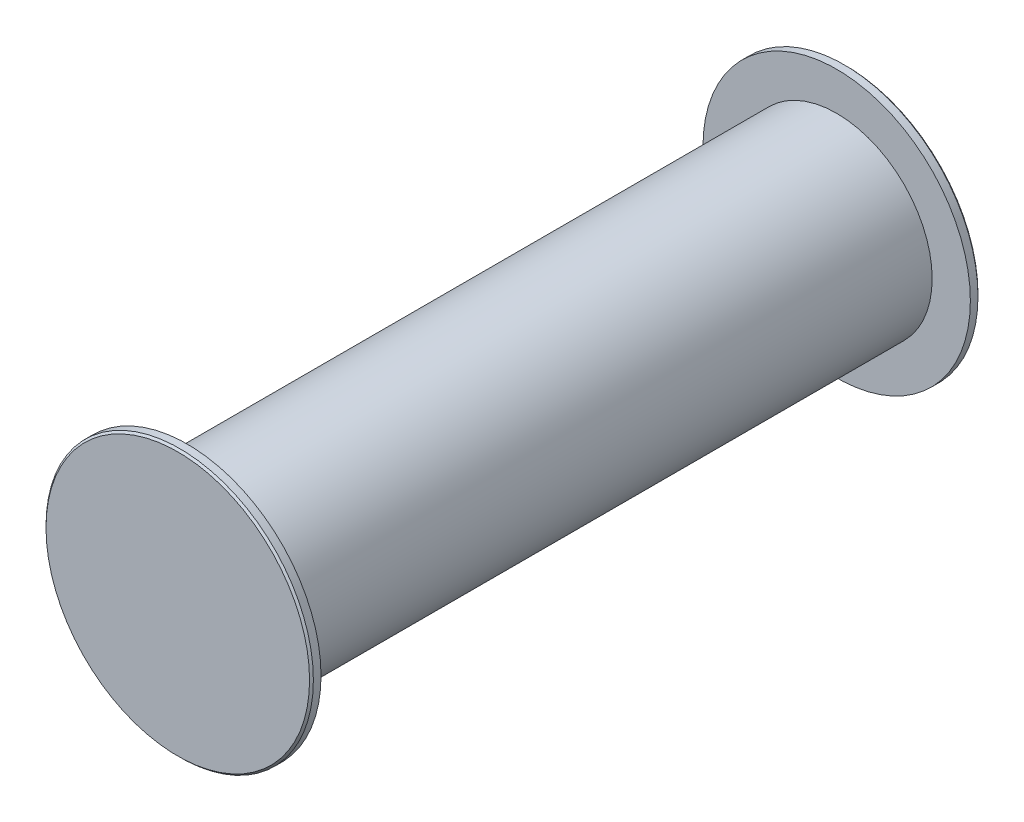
ISO-10303-21;
HEADER;
FILE_DESCRIPTION(('STEP AP214'),'2;1');
FILE_NAME('part.step','',(''),(''),'','','');
FILE_SCHEMA(('AUTOMOTIVE_DESIGN { 1 0 10303 214 1 1 1 1 }'));
ENDSEC;
DATA;
#1=APPLICATION_CONTEXT('core data for automotive mechanical design processes');
#2=APPLICATION_PROTOCOL_DEFINITION('international standard','automotive_design',2000,#1);
#3=PRODUCT_CONTEXT('',#1,'mechanical');
#4=PRODUCT('Part','Part','',(#3));
#5=PRODUCT_RELATED_PRODUCT_CATEGORY('part','',(#4));
#6=PRODUCT_DEFINITION_FORMATION('','',#4);
#7=PRODUCT_DEFINITION_CONTEXT('part definition',#1,'design');
#8=PRODUCT_DEFINITION('design','',#6,#7);
#9=PRODUCT_DEFINITION_SHAPE('','',#8);
#10=(LENGTH_UNIT() NAMED_UNIT(*) SI_UNIT(.MILLI.,.METRE.));
#11=(NAMED_UNIT(*) PLANE_ANGLE_UNIT() SI_UNIT($,.RADIAN.));
#12=(NAMED_UNIT(*) SI_UNIT($,.STERADIAN.) SOLID_ANGLE_UNIT());
#13=UNCERTAINTY_MEASURE_WITH_UNIT(LENGTH_MEASURE(1.E-05),#10,'distance_accuracy_value','');
#14=(GEOMETRIC_REPRESENTATION_CONTEXT(3) GLOBAL_UNCERTAINTY_ASSIGNED_CONTEXT((#13)) GLOBAL_UNIT_ASSIGNED_CONTEXT((#10,
#11,#12)) REPRESENTATION_CONTEXT('',''));
#15=CARTESIAN_POINT('',(0.,0.,0.));
#16=DIRECTION('',(0.,0.,1.));
#17=DIRECTION('',(1.,0.,0.));
#18=AXIS2_PLACEMENT_3D('',#15,#16,#17);
#19=CARTESIAN_POINT('',(0.,0.,34.));
#20=DIRECTION('',(0.,0.,-1.));
#21=DIRECTION('',(-1.,0.,0.));
#22=AXIS2_PLACEMENT_3D('',#19,#20,#21);
#23=CYLINDRICAL_SURFACE('',#22,5.);
#24=CARTESIAN_POINT('',(0.,0.,34.));
#25=DIRECTION('',(0.,0.,1.));
#26=DIRECTION('',(1.,0.,0.));
#27=AXIS2_PLACEMENT_3D('',#24,#25,#26);
#28=CIRCLE('',#27,5.);
#29=CARTESIAN_POINT('',(5.,0.,34.));
#30=VERTEX_POINT('',#29);
#31=EDGE_CURVE('E49',#30,#30,#28,.T.);
#32=ORIENTED_EDGE('',*,*,#31,.F.);
#33=EDGE_LOOP('',(#32));
#34=FACE_BOUND('',#33,.T.);
#35=CARTESIAN_POINT('',(0.,0.,0.));
#36=DIRECTION('',(0.,0.,-1.));
#37=DIRECTION('',(-1.,0.,0.));
#38=AXIS2_PLACEMENT_3D('',#35,#36,#37);
#39=CIRCLE('',#38,5.);
#40=CARTESIAN_POINT('',(-5.,0.,0.));
#41=VERTEX_POINT('',#40);
#42=EDGE_CURVE('E55',#41,#41,#39,.T.);
#43=ORIENTED_EDGE('',*,*,#42,.F.);
#44=EDGE_LOOP('',(#43));
#45=FACE_BOUND('',#44,.T.);
#46=ADVANCED_FACE('F30',(#34,#45),#23,.T.);
#47=CARTESIAN_POINT('',(0.,0.,34.));
#48=DIRECTION('',(0.,0.,1.));
#49=DIRECTION('',(1.,0.,0.));
#50=AXIS2_PLACEMENT_3D('',#47,#48,#49);
#51=PLANE('',#50);
#52=CARTESIAN_POINT('',(0.,0.,34.));
#53=DIRECTION('',(0.,0.,1.));
#54=DIRECTION('',(1.,0.,0.));
#55=AXIS2_PLACEMENT_3D('',#52,#53,#54);
#56=CIRCLE('',#55,7.);
#57=CARTESIAN_POINT('',(7.,0.,34.));
#58=VERTEX_POINT('',#57);
#59=EDGE_CURVE('E52',#58,#58,#56,.T.);
#60=ORIENTED_EDGE('',*,*,#59,.F.);
#61=EDGE_LOOP('',(#60));
#62=FACE_BOUND('',#61,.T.);
#63=ORIENTED_EDGE('',*,*,#31,.T.);
#64=EDGE_LOOP('',(#63));
#65=FACE_BOUND('',#64,.T.);
#66=ADVANCED_FACE('F72',(#62,#65),#51,.F.);
#67=CARTESIAN_POINT('',(0.,0.,34.5));
#68=DIRECTION('',(0.,0.,-1.));
#69=DIRECTION('',(-1.,0.,0.));
#70=AXIS2_PLACEMENT_3D('',#67,#68,#69);
#71=CYLINDRICAL_SURFACE('',#70,7.);
#72=CARTESIAN_POINT('',(0.,0.,34.4));
#73=DIRECTION('',(0.,0.,1.));
#74=DIRECTION('',(1.,0.,0.));
#75=AXIS2_PLACEMENT_3D('',#72,#73,#74);
#76=CIRCLE('',#75,7.);
#77=CARTESIAN_POINT('',(7.,0.,34.4));
#78=VERTEX_POINT('',#77);
#79=EDGE_CURVE('E40',#78,#78,#76,.F.);
#80=ORIENTED_EDGE('',*,*,#79,.T.);
#81=EDGE_LOOP('',(#80));
#82=FACE_BOUND('',#81,.T.);
#83=ORIENTED_EDGE('',*,*,#59,.T.);
#84=EDGE_LOOP('',(#83));
#85=FACE_BOUND('',#84,.T.);
#86=ADVANCED_FACE('F77',(#82,#85),#71,.T.);
#87=CARTESIAN_POINT('',(0.,0.,34.5));
#88=DIRECTION('',(0.,0.,1.));
#89=DIRECTION('',(1.,0.,0.));
#90=AXIS2_PLACEMENT_3D('',#87,#88,#89);
#91=PLANE('',#90);
#92=CARTESIAN_POINT('',(0.,0.,34.5));
#93=DIRECTION('',(0.,0.,1.));
#94=DIRECTION('',(1.,0.,0.));
#95=AXIS2_PLACEMENT_3D('',#92,#93,#94);
#96=CIRCLE('',#95,6.9);
#97=CARTESIAN_POINT('',(6.9,0.,34.5));
#98=VERTEX_POINT('',#97);
#99=EDGE_CURVE('E44',#98,#98,#96,.T.);
#100=ORIENTED_EDGE('',*,*,#99,.T.);
#101=EDGE_LOOP('',(#100));
#102=FACE_BOUND('',#101,.T.);
#103=ADVANCED_FACE('F85',(#102),#91,.T.);
#104=CARTESIAN_POINT('',(0.,0.,34.5));
#105=DIRECTION('',(0.,0.,-1.));
#106=DIRECTION('',(-1.,0.,0.));
#107=AXIS2_PLACEMENT_3D('',#104,#105,#106);
#108=CONICAL_SURFACE('',#107,6.9,0.785398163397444);
#109=ORIENTED_EDGE('',*,*,#79,.F.);
#110=EDGE_LOOP('',(#109));
#111=FACE_BOUND('',#110,.T.);
#112=ORIENTED_EDGE('',*,*,#99,.F.);
#113=EDGE_LOOP('',(#112));
#114=FACE_BOUND('',#113,.T.);
#115=ADVANCED_FACE('F67',(#111,#114),#108,.T.);
#116=CARTESIAN_POINT('',(0.,0.,0.));
#117=DIRECTION('',(0.,0.,-1.));
#118=DIRECTION('',(-1.,0.,0.));
#119=AXIS2_PLACEMENT_3D('',#116,#117,#118);
#120=PLANE('',#119);
#121=CARTESIAN_POINT('',(0.,0.,0.));
#122=DIRECTION('',(0.,0.,-1.));
#123=DIRECTION('',(-1.,0.,0.));
#124=AXIS2_PLACEMENT_3D('',#121,#122,#123);
#125=CIRCLE('',#124,7.);
#126=CARTESIAN_POINT('',(-7.,0.,0.));
#127=VERTEX_POINT('',#126);
#128=EDGE_CURVE('E58',#127,#127,#125,.T.);
#129=ORIENTED_EDGE('',*,*,#128,.F.);
#130=EDGE_LOOP('',(#129));
#131=FACE_BOUND('',#130,.T.);
#132=ORIENTED_EDGE('',*,*,#42,.T.);
#133=EDGE_LOOP('',(#132));
#134=FACE_BOUND('',#133,.T.);
#135=ADVANCED_FACE('F64',(#131,#134),#120,.F.);
#136=CARTESIAN_POINT('',(0.,0.,-0.5));
#137=DIRECTION('',(0.,0.,1.));
#138=DIRECTION('',(1.,0.,0.));
#139=AXIS2_PLACEMENT_3D('',#136,#137,#138);
#140=CYLINDRICAL_SURFACE('',#139,7.);
#141=CARTESIAN_POINT('',(0.,0.,-0.400000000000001));
#142=DIRECTION('',(0.,0.,-1.));
#143=DIRECTION('',(-1.,0.,0.));
#144=AXIS2_PLACEMENT_3D('',#141,#142,#143);
#145=CIRCLE('',#144,7.);
#146=CARTESIAN_POINT('',(-7.,0.,-0.400000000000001));
#147=VERTEX_POINT('',#146);
#148=EDGE_CURVE('E10',#147,#147,#145,.F.);
#149=ORIENTED_EDGE('',*,*,#148,.T.);
#150=EDGE_LOOP('',(#149));
#151=FACE_BOUND('',#150,.T.);
#152=ORIENTED_EDGE('',*,*,#128,.T.);
#153=EDGE_LOOP('',(#152));
#154=FACE_BOUND('',#153,.T.);
#155=ADVANCED_FACE('F62',(#151,#154),#140,.T.);
#156=CARTESIAN_POINT('',(0.,0.,-0.5));
#157=DIRECTION('',(0.,0.,-1.));
#158=DIRECTION('',(-1.,0.,0.));
#159=AXIS2_PLACEMENT_3D('',#156,#157,#158);
#160=PLANE('',#159);
#161=CARTESIAN_POINT('',(0.,0.,-0.5));
#162=DIRECTION('',(0.,0.,-1.));
#163=DIRECTION('',(-1.,0.,0.));
#164=AXIS2_PLACEMENT_3D('',#161,#162,#163);
#165=CIRCLE('',#164,6.9);
#166=CARTESIAN_POINT('',(-6.9,0.,-0.5));
#167=VERTEX_POINT('',#166);
#168=EDGE_CURVE('E36',#167,#167,#165,.T.);
#169=ORIENTED_EDGE('',*,*,#168,.T.);
#170=EDGE_LOOP('',(#169));
#171=FACE_BOUND('',#170,.T.);
#172=ADVANCED_FACE('F113',(#171),#160,.T.);
#173=CARTESIAN_POINT('',(0.,0.,-0.5));
#174=DIRECTION('',(0.,0.,1.));
#175=DIRECTION('',(1.,0.,0.));
#176=AXIS2_PLACEMENT_3D('',#173,#174,#175);
#177=CONICAL_SURFACE('',#176,6.9,0.78539816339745);
#178=ORIENTED_EDGE('',*,*,#148,.F.);
#179=EDGE_LOOP('',(#178));
#180=FACE_BOUND('',#179,.T.);
#181=ORIENTED_EDGE('',*,*,#168,.F.);
#182=EDGE_LOOP('',(#181));
#183=FACE_BOUND('',#182,.T.);
#184=ADVANCED_FACE('F119',(#180,#183),#177,.T.);
#185=CLOSED_SHELL('',(#46,#66,#86,#103,#115,#135,#155,#172,#184));
#186=MANIFOLD_SOLID_BREP('B2',#185);
#187=ADVANCED_BREP_SHAPE_REPRESENTATION('',(#18,#186),#14);
#188=SHAPE_DEFINITION_REPRESENTATION(#9,#187);
ENDSEC;
END-ISO-10303-21;
